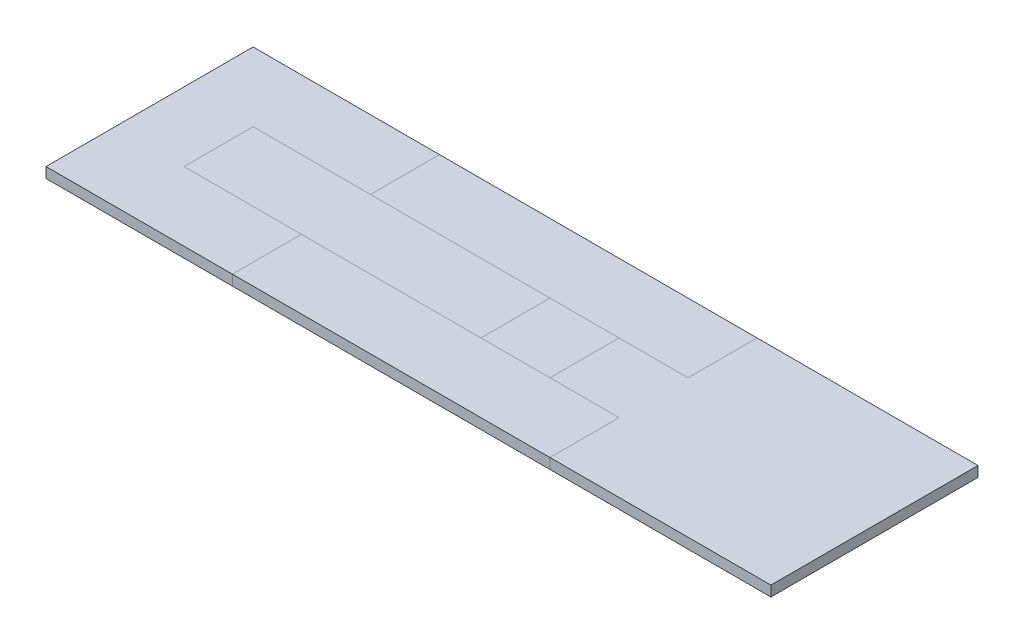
ISO-10303-21;
HEADER;
FILE_DESCRIPTION(('STEP AP214'),'2;1');
FILE_NAME('part.step','',(''),(''),'','','');
FILE_SCHEMA(('AUTOMOTIVE_DESIGN { 1 0 10303 214 1 1 1 1 }'));
ENDSEC;
DATA;
#1=APPLICATION_CONTEXT('core data for automotive mechanical design processes');
#2=APPLICATION_PROTOCOL_DEFINITION('international standard','automotive_design',2000,#1);
#3=PRODUCT_CONTEXT('',#1,'mechanical');
#4=PRODUCT('Part','Part','',(#3));
#5=PRODUCT_RELATED_PRODUCT_CATEGORY('part','',(#4));
#6=PRODUCT_DEFINITION_FORMATION('','',#4);
#7=PRODUCT_DEFINITION_CONTEXT('part definition',#1,'design');
#8=PRODUCT_DEFINITION('design','',#6,#7);
#9=PRODUCT_DEFINITION_SHAPE('','',#8);
#10=(LENGTH_UNIT() NAMED_UNIT(*) SI_UNIT(.MILLI.,.METRE.));
#11=(NAMED_UNIT(*) PLANE_ANGLE_UNIT() SI_UNIT($,.RADIAN.));
#12=(NAMED_UNIT(*) SI_UNIT($,.STERADIAN.) SOLID_ANGLE_UNIT());
#13=UNCERTAINTY_MEASURE_WITH_UNIT(LENGTH_MEASURE(1.E-05),#10,'distance_accuracy_value','');
#14=(GEOMETRIC_REPRESENTATION_CONTEXT(3) GLOBAL_UNCERTAINTY_ASSIGNED_CONTEXT((#13)) GLOBAL_UNIT_ASSIGNED_CONTEXT((#10,
#11,#12)) REPRESENTATION_CONTEXT('',''));
#15=CARTESIAN_POINT('',(0.,0.,0.));
#16=DIRECTION('',(0.,0.,1.));
#17=DIRECTION('',(1.,0.,0.));
#18=AXIS2_PLACEMENT_3D('',#15,#16,#17);
#19=CARTESIAN_POINT('',(31.5,-0.01,-5.));
#20=DIRECTION('',(0.,0.,-1.));
#21=DIRECTION('',(-1.,0.,0.));
#22=AXIS2_PLACEMENT_3D('',#19,#20,#21);
#23=PLANE('',#22);
#24=DIRECTION('',(0.,1.,0.));
#25=VECTOR('',#24,1.);
#26=CARTESIAN_POINT('',(41.5,-0.01,-5.));
#27=LINE('',#26,#25);
#28=CARTESIAN_POINT('',(41.5,0.,-5.));
#29=VERTEX_POINT('',#28);
#30=CARTESIAN_POINT('',(41.5,1.5,-5.));
#31=VERTEX_POINT('',#30);
#32=EDGE_CURVE('E12',#29,#31,#27,.T.);
#33=ORIENTED_EDGE('',*,*,#32,.F.);
#34=DIRECTION('',(-1.,0.,0.));
#35=VECTOR('',#34,1.);
#36=CARTESIAN_POINT('',(0.,0.,-4.99999999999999));
#37=LINE('',#36,#35);
#38=CARTESIAN_POINT('',(31.5,0.,-5.));
#39=VERTEX_POINT('',#38);
#40=EDGE_CURVE('E135',#29,#39,#37,.T.);
#41=ORIENTED_EDGE('',*,*,#40,.T.);
#42=DIRECTION('',(0.,1.,0.));
#43=VECTOR('',#42,1.);
#44=CARTESIAN_POINT('',(31.5,-0.01,-5.));
#45=LINE('',#44,#43);
#46=CARTESIAN_POINT('',(31.5,1.5,-5.));
#47=VERTEX_POINT('',#46);
#48=EDGE_CURVE('E151',#39,#47,#45,.T.);
#49=ORIENTED_EDGE('',*,*,#48,.T.);
#50=DIRECTION('',(-1.,0.,0.));
#51=VECTOR('',#50,1.);
#52=CARTESIAN_POINT('',(0.,1.5,-4.99999999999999));
#53=LINE('',#52,#51);
#54=EDGE_CURVE('E147',#31,#47,#53,.T.);
#55=ORIENTED_EDGE('',*,*,#54,.F.);
#56=EDGE_LOOP('',(#33,#41,#49,#55));
#57=FACE_BOUND('',#56,.T.);
#58=ADVANCED_FACE('F47',(#57),#23,.T.);
#59=CARTESIAN_POINT('',(41.5,-0.01,-15.));
#60=DIRECTION('',(-1.,0.,0.));
#61=DIRECTION('',(0.,0.,1.));
#62=AXIS2_PLACEMENT_3D('',#59,#60,#61);
#63=PLANE('',#62);
#64=DIRECTION('',(0.,1.,0.));
#65=VECTOR('',#64,1.);
#66=CARTESIAN_POINT('',(41.5,1.5,-15.));
#67=LINE('',#66,#65);
#68=CARTESIAN_POINT('',(41.5,0.,-15.));
#69=VERTEX_POINT('',#68);
#70=CARTESIAN_POINT('',(41.5,1.5,-15.));
#71=VERTEX_POINT('',#70);
#72=EDGE_CURVE('E131',#69,#71,#67,.T.);
#73=ORIENTED_EDGE('',*,*,#72,.F.);
#74=DIRECTION('',(0.,0.,1.));
#75=VECTOR('',#74,1.);
#76=CARTESIAN_POINT('',(41.5,0.,0.));
#77=LINE('',#76,#75);
#78=EDGE_CURVE('E139',#69,#29,#77,.T.);
#79=ORIENTED_EDGE('',*,*,#78,.T.);
#80=ORIENTED_EDGE('',*,*,#32,.T.);
#81=DIRECTION('',(0.,0.,1.));
#82=VECTOR('',#81,1.);
#83=CARTESIAN_POINT('',(41.5,1.5,0.));
#84=LINE('',#83,#82);
#85=EDGE_CURVE('E177',#71,#31,#84,.T.);
#86=ORIENTED_EDGE('',*,*,#85,.F.);
#87=EDGE_LOOP('',(#73,#79,#80,#86));
#88=FACE_BOUND('',#87,.T.);
#89=ADVANCED_FACE('F187',(#88),#63,.T.);
#90=CARTESIAN_POINT('',(41.5,-0.01,15.));
#91=DIRECTION('',(-1.,0.,0.));
#92=DIRECTION('',(0.,0.,1.));
#93=AXIS2_PLACEMENT_3D('',#90,#91,#92);
#94=PLANE('',#93);
#95=DIRECTION('',(0.,1.,0.));
#96=VECTOR('',#95,1.);
#97=CARTESIAN_POINT('',(41.5,-0.01,5.));
#98=LINE('',#97,#96);
#99=CARTESIAN_POINT('',(41.5,0.,5.));
#100=VERTEX_POINT('',#99);
#101=CARTESIAN_POINT('',(41.5,1.5,5.));
#102=VERTEX_POINT('',#101);
#103=EDGE_CURVE('E51',#100,#102,#98,.T.);
#104=ORIENTED_EDGE('',*,*,#103,.F.);
#105=DIRECTION('',(0.,0.,1.));
#106=VECTOR('',#105,1.);
#107=CARTESIAN_POINT('',(41.5,0.,0.));
#108=LINE('',#107,#106);
#109=CARTESIAN_POINT('',(41.5,0.,15.));
#110=VERTEX_POINT('',#109);
#111=EDGE_CURVE('E121',#100,#110,#108,.T.);
#112=ORIENTED_EDGE('',*,*,#111,.T.);
#113=DIRECTION('',(0.,1.,0.));
#114=VECTOR('',#113,1.);
#115=CARTESIAN_POINT('',(41.5,1.5,15.));
#116=LINE('',#115,#114);
#117=CARTESIAN_POINT('',(41.5,1.5,15.));
#118=VERTEX_POINT('',#117);
#119=EDGE_CURVE('E128',#110,#118,#116,.T.);
#120=ORIENTED_EDGE('',*,*,#119,.T.);
#121=DIRECTION('',(0.,0.,1.));
#122=VECTOR('',#121,1.);
#123=CARTESIAN_POINT('',(41.5,1.5,0.));
#124=LINE('',#123,#122);
#125=EDGE_CURVE('E144',#102,#118,#124,.T.);
#126=ORIENTED_EDGE('',*,*,#125,.F.);
#127=EDGE_LOOP('',(#104,#112,#120,#126));
#128=FACE_BOUND('',#127,.T.);
#129=ADVANCED_FACE('F134',(#128),#94,.T.);
#130=CARTESIAN_POINT('',(31.5,-0.01,5.));
#131=DIRECTION('',(0.,0.,1.));
#132=DIRECTION('',(1.,0.,0.));
#133=AXIS2_PLACEMENT_3D('',#130,#131,#132);
#134=PLANE('',#133);
#135=DIRECTION('',(0.,-1.,0.));
#136=VECTOR('',#135,1.);
#137=CARTESIAN_POINT('',(31.5,-0.01,5.));
#138=LINE('',#137,#136);
#139=CARTESIAN_POINT('',(31.5,1.5,5.));
#140=VERTEX_POINT('',#139);
#141=CARTESIAN_POINT('',(31.5,0.,5.));
#142=VERTEX_POINT('',#141);
#143=EDGE_CURVE('E124',#140,#142,#138,.T.);
#144=ORIENTED_EDGE('',*,*,#143,.T.);
#145=DIRECTION('',(1.,0.,0.));
#146=VECTOR('',#145,1.);
#147=CARTESIAN_POINT('',(0.,0.,5.));
#148=LINE('',#147,#146);
#149=EDGE_CURVE('E136',#142,#100,#148,.T.);
#150=ORIENTED_EDGE('',*,*,#149,.T.);
#151=ORIENTED_EDGE('',*,*,#103,.T.);
#152=DIRECTION('',(1.,0.,0.));
#153=VECTOR('',#152,1.);
#154=CARTESIAN_POINT('',(0.,1.5,5.));
#155=LINE('',#154,#153);
#156=EDGE_CURVE('E146',#140,#102,#155,.T.);
#157=ORIENTED_EDGE('',*,*,#156,.F.);
#158=EDGE_LOOP('',(#144,#150,#151,#157));
#159=FACE_BOUND('',#158,.T.);
#160=ADVANCED_FACE('F203',(#159),#134,.T.);
#161=CARTESIAN_POINT('',(31.5,-0.01,-5.));
#162=DIRECTION('',(-1.,0.,0.));
#163=DIRECTION('',(0.,0.,1.));
#164=AXIS2_PLACEMENT_3D('',#161,#162,#163);
#165=PLANE('',#164);
#166=ORIENTED_EDGE('',*,*,#48,.F.);
#167=DIRECTION('',(0.,0.,1.));
#168=VECTOR('',#167,1.);
#169=CARTESIAN_POINT('',(31.5,0.,0.));
#170=LINE('',#169,#168);
#171=EDGE_CURVE('E132',#39,#142,#170,.T.);
#172=ORIENTED_EDGE('',*,*,#171,.T.);
#173=ORIENTED_EDGE('',*,*,#143,.F.);
#174=DIRECTION('',(0.,0.,1.));
#175=VECTOR('',#174,1.);
#176=CARTESIAN_POINT('',(31.5,1.5,0.));
#177=LINE('',#176,#175);
#178=EDGE_CURVE('E175',#47,#140,#177,.T.);
#179=ORIENTED_EDGE('',*,*,#178,.F.);
#180=EDGE_LOOP('',(#166,#172,#173,#179));
#181=FACE_BOUND('',#180,.T.);
#182=ADVANCED_FACE('F198',(#181),#165,.T.);
#183=CARTESIAN_POINT('',(0.,1.5,15.));
#184=DIRECTION('',(0.,0.,-1.));
#185=DIRECTION('',(-1.,0.,0.));
#186=AXIS2_PLACEMENT_3D('',#183,#184,#185);
#187=PLANE('',#186);
#188=ORIENTED_EDGE('',*,*,#119,.F.);
#189=DIRECTION('',(1.,0.,0.));
#190=VECTOR('',#189,1.);
#191=CARTESIAN_POINT('',(0.,0.,15.));
#192=LINE('',#191,#190);
#193=CARTESIAN_POINT('',(73.5,0.,15.));
#194=VERTEX_POINT('',#193);
#195=EDGE_CURVE('E65',#110,#194,#192,.T.);
#196=ORIENTED_EDGE('',*,*,#195,.T.);
#197=DIRECTION('',(0.,-1.,0.));
#198=VECTOR('',#197,1.);
#199=CARTESIAN_POINT('',(73.5,1.5,15.));
#200=LINE('',#199,#198);
#201=CARTESIAN_POINT('',(73.5,1.5,15.));
#202=VERTEX_POINT('',#201);
#203=EDGE_CURVE('E149',#202,#194,#200,.T.);
#204=ORIENTED_EDGE('',*,*,#203,.F.);
#205=DIRECTION('',(1.,0.,0.));
#206=VECTOR('',#205,1.);
#207=CARTESIAN_POINT('',(0.,1.5,15.));
#208=LINE('',#207,#206);
#209=EDGE_CURVE('E130',#118,#202,#208,.T.);
#210=ORIENTED_EDGE('',*,*,#209,.F.);
#211=EDGE_LOOP('',(#188,#196,#204,#210));
#212=FACE_BOUND('',#211,.T.);
#213=ADVANCED_FACE('F129',(#212),#187,.F.);
#214=CARTESIAN_POINT('',(73.5,1.5,0.));
#215=DIRECTION('',(1.,0.,0.));
#216=DIRECTION('',(0.,0.,-1.));
#217=AXIS2_PLACEMENT_3D('',#214,#215,#216);
#218=PLANE('',#217);
#219=DIRECTION('',(0.,0.,1.));
#220=VECTOR('',#219,1.);
#221=CARTESIAN_POINT('',(73.5,0.,0.));
#222=LINE('',#221,#220);
#223=CARTESIAN_POINT('',(73.5,0.,-15.));
#224=VERTEX_POINT('',#223);
#225=EDGE_CURVE('E123',#224,#194,#222,.T.);
#226=ORIENTED_EDGE('',*,*,#225,.F.);
#227=DIRECTION('',(0.,-1.,0.));
#228=VECTOR('',#227,1.);
#229=CARTESIAN_POINT('',(73.5,1.5,-15.));
#230=LINE('',#229,#228);
#231=CARTESIAN_POINT('',(73.5,1.5,-15.));
#232=VERTEX_POINT('',#231);
#233=EDGE_CURVE('E166',#232,#224,#230,.T.);
#234=ORIENTED_EDGE('',*,*,#233,.F.);
#235=DIRECTION('',(0.,0.,1.));
#236=VECTOR('',#235,1.);
#237=CARTESIAN_POINT('',(73.5,1.5,0.));
#238=LINE('',#237,#236);
#239=EDGE_CURVE('E165',#232,#202,#238,.T.);
#240=ORIENTED_EDGE('',*,*,#239,.T.);
#241=ORIENTED_EDGE('',*,*,#203,.T.);
#242=EDGE_LOOP('',(#226,#234,#240,#241));
#243=FACE_BOUND('',#242,.T.);
#244=ADVANCED_FACE('F189',(#243),#218,.T.);
#245=CARTESIAN_POINT('',(0.,1.5,-15.));
#246=DIRECTION('',(0.,0.,-1.));
#247=DIRECTION('',(-1.,0.,0.));
#248=AXIS2_PLACEMENT_3D('',#245,#246,#247);
#249=PLANE('',#248);
#250=DIRECTION('',(1.,0.,0.));
#251=VECTOR('',#250,1.);
#252=CARTESIAN_POINT('',(0.,0.,-15.));
#253=LINE('',#252,#251);
#254=EDGE_CURVE('E163',#69,#224,#253,.T.);
#255=ORIENTED_EDGE('',*,*,#254,.F.);
#256=ORIENTED_EDGE('',*,*,#72,.T.);
#257=DIRECTION('',(1.,0.,0.));
#258=VECTOR('',#257,1.);
#259=CARTESIAN_POINT('',(0.,1.5,-15.));
#260=LINE('',#259,#258);
#261=EDGE_CURVE('E77',#71,#232,#260,.T.);
#262=ORIENTED_EDGE('',*,*,#261,.T.);
#263=ORIENTED_EDGE('',*,*,#233,.T.);
#264=EDGE_LOOP('',(#255,#256,#262,#263));
#265=FACE_BOUND('',#264,.T.);
#266=ADVANCED_FACE('F188',(#265),#249,.T.);
#267=CARTESIAN_POINT('',(0.,0.,0.));
#268=DIRECTION('',(0.,1.,0.));
#269=DIRECTION('',(0.,0.,1.));
#270=AXIS2_PLACEMENT_3D('',#267,#268,#269);
#271=PLANE('',#270);
#272=ORIENTED_EDGE('',*,*,#171,.F.);
#273=ORIENTED_EDGE('',*,*,#40,.F.);
#274=ORIENTED_EDGE('',*,*,#78,.F.);
#275=ORIENTED_EDGE('',*,*,#254,.T.);
#276=ORIENTED_EDGE('',*,*,#225,.T.);
#277=ORIENTED_EDGE('',*,*,#195,.F.);
#278=ORIENTED_EDGE('',*,*,#111,.F.);
#279=ORIENTED_EDGE('',*,*,#149,.F.);
#280=EDGE_LOOP('',(#272,#273,#274,#275,#276,#277,#278,#279));
#281=FACE_BOUND('',#280,.T.);
#282=ADVANCED_FACE('F119',(#281),#271,.F.);
#283=CARTESIAN_POINT('',(0.,1.5,0.));
#284=DIRECTION('',(0.,1.,0.));
#285=DIRECTION('',(0.,0.,1.));
#286=AXIS2_PLACEMENT_3D('',#283,#284,#285);
#287=PLANE('',#286);
#288=ORIENTED_EDGE('',*,*,#54,.T.);
#289=ORIENTED_EDGE('',*,*,#178,.T.);
#290=ORIENTED_EDGE('',*,*,#156,.T.);
#291=ORIENTED_EDGE('',*,*,#125,.T.);
#292=ORIENTED_EDGE('',*,*,#209,.T.);
#293=ORIENTED_EDGE('',*,*,#239,.F.);
#294=ORIENTED_EDGE('',*,*,#261,.F.);
#295=ORIENTED_EDGE('',*,*,#85,.T.);
#296=EDGE_LOOP('',(#288,#289,#290,#291,#292,#293,#294,#295));
#297=FACE_BOUND('',#296,.T.);
#298=ADVANCED_FACE('F49',(#297),#287,.T.);
#299=CLOSED_SHELL('',(#58,#89,#129,#160,#182,#213,#244,#266,#282,#298));
#300=MANIFOLD_SOLID_BREP('B2',#299);
#301=CARTESIAN_POINT('',(41.5,-0.01,15.));
#302=DIRECTION('',(-1.,0.,0.));
#303=DIRECTION('',(0.,0.,1.));
#304=AXIS2_PLACEMENT_3D('',#301,#302,#303);
#305=PLANE('',#304);
#306=DIRECTION('',(0.,1.,0.));
#307=VECTOR('',#306,1.);
#308=CARTESIAN_POINT('',(41.5,-0.01,5.));
#309=LINE('',#308,#307);
#310=CARTESIAN_POINT('',(41.5,0.,5.));
#311=VERTEX_POINT('',#310);
#312=CARTESIAN_POINT('',(41.5,1.5,5.));
#313=VERTEX_POINT('',#312);
#314=EDGE_CURVE('E324',#311,#313,#309,.T.);
#315=ORIENTED_EDGE('',*,*,#314,.T.);
#316=DIRECTION('',(0.,0.,1.));
#317=VECTOR('',#316,1.);
#318=CARTESIAN_POINT('',(41.5,1.5,0.));
#319=LINE('',#318,#317);
#320=CARTESIAN_POINT('',(41.5,1.5,15.));
#321=VERTEX_POINT('',#320);
#322=EDGE_CURVE('E375',#313,#321,#319,.T.);
#323=ORIENTED_EDGE('',*,*,#322,.T.);
#324=DIRECTION('',(0.,1.,0.));
#325=VECTOR('',#324,1.);
#326=CARTESIAN_POINT('',(41.5,1.5,15.));
#327=LINE('',#326,#325);
#328=CARTESIAN_POINT('',(41.5,0.,15.));
#329=VERTEX_POINT('',#328);
#330=EDGE_CURVE('E374',#329,#321,#327,.T.);
#331=ORIENTED_EDGE('',*,*,#330,.F.);
#332=DIRECTION('',(0.,0.,1.));
#333=VECTOR('',#332,1.);
#334=CARTESIAN_POINT('',(41.5,0.,0.));
#335=LINE('',#334,#333);
#336=EDGE_CURVE('E337',#311,#329,#335,.T.);
#337=ORIENTED_EDGE('',*,*,#336,.F.);
#338=EDGE_LOOP('',(#315,#323,#331,#337));
#339=FACE_BOUND('',#338,.T.);
#340=ADVANCED_FACE('F320',(#339),#305,.F.);
#341=CARTESIAN_POINT('',(31.5,-0.01,5.));
#342=DIRECTION('',(0.,0.,1.));
#343=DIRECTION('',(1.,0.,0.));
#344=AXIS2_PLACEMENT_3D('',#341,#342,#343);
#345=PLANE('',#344);
#346=DIRECTION('',(1.,0.,0.));
#347=VECTOR('',#346,1.);
#348=CARTESIAN_POINT('',(0.,0.,5.));
#349=LINE('',#348,#347);
#350=CARTESIAN_POINT('',(-4.5,0.,5.));
#351=VERTEX_POINT('',#350);
#352=EDGE_CURVE('E386',#351,#311,#349,.T.);
#353=ORIENTED_EDGE('',*,*,#352,.F.);
#354=DIRECTION('',(0.,1.,0.));
#355=VECTOR('',#354,1.);
#356=CARTESIAN_POINT('',(-4.5,-0.01,5.));
#357=LINE('',#356,#355);
#358=CARTESIAN_POINT('',(-4.5,1.5,5.));
#359=VERTEX_POINT('',#358);
#360=EDGE_CURVE('E45',#351,#359,#357,.T.);
#361=ORIENTED_EDGE('',*,*,#360,.T.);
#362=DIRECTION('',(-1.,0.,0.));
#363=VECTOR('',#362,1.);
#364=CARTESIAN_POINT('',(0.,1.5,5.));
#365=LINE('',#364,#363);
#366=EDGE_CURVE('E382',#313,#359,#365,.T.);
#367=ORIENTED_EDGE('',*,*,#366,.F.);
#368=ORIENTED_EDGE('',*,*,#314,.F.);
#369=EDGE_LOOP('',(#353,#361,#367,#368));
#370=FACE_BOUND('',#369,.T.);
#371=ADVANCED_FACE('F394',(#370),#345,.F.);
#372=CARTESIAN_POINT('',(-4.5,-0.01,15.));
#373=DIRECTION('',(-1.,0.,0.));
#374=DIRECTION('',(0.,0.,1.));
#375=AXIS2_PLACEMENT_3D('',#372,#373,#374);
#376=PLANE('',#375);
#377=ORIENTED_EDGE('',*,*,#360,.F.);
#378=DIRECTION('',(0.,0.,1.));
#379=VECTOR('',#378,1.);
#380=CARTESIAN_POINT('',(-4.5,0.,0.));
#381=LINE('',#380,#379);
#382=CARTESIAN_POINT('',(-4.5,0.,15.));
#383=VERTEX_POINT('',#382);
#384=EDGE_CURVE('E366',#351,#383,#381,.T.);
#385=ORIENTED_EDGE('',*,*,#384,.T.);
#386=DIRECTION('',(0.,1.,0.));
#387=VECTOR('',#386,1.);
#388=CARTESIAN_POINT('',(-4.5,1.5,15.));
#389=LINE('',#388,#387);
#390=CARTESIAN_POINT('',(-4.5,1.5,15.));
#391=VERTEX_POINT('',#390);
#392=EDGE_CURVE('E372',#383,#391,#389,.T.);
#393=ORIENTED_EDGE('',*,*,#392,.T.);
#394=DIRECTION('',(0.,0.,1.));
#395=VECTOR('',#394,1.);
#396=CARTESIAN_POINT('',(-4.5,1.5,0.));
#397=LINE('',#396,#395);
#398=EDGE_CURVE('E345',#359,#391,#397,.T.);
#399=ORIENTED_EDGE('',*,*,#398,.F.);
#400=EDGE_LOOP('',(#377,#385,#393,#399));
#401=FACE_BOUND('',#400,.T.);
#402=ADVANCED_FACE('F377',(#401),#376,.T.);
#403=CARTESIAN_POINT('',(0.,1.5,15.));
#404=DIRECTION('',(0.,0.,-1.));
#405=DIRECTION('',(-1.,0.,0.));
#406=AXIS2_PLACEMENT_3D('',#403,#404,#405);
#407=PLANE('',#406);
#408=DIRECTION('',(1.,0.,0.));
#409=VECTOR('',#408,1.);
#410=CARTESIAN_POINT('',(0.,0.,15.));
#411=LINE('',#410,#409);
#412=EDGE_CURVE('E329',#383,#329,#411,.T.);
#413=ORIENTED_EDGE('',*,*,#412,.T.);
#414=ORIENTED_EDGE('',*,*,#330,.T.);
#415=DIRECTION('',(1.,0.,0.));
#416=VECTOR('',#415,1.);
#417=CARTESIAN_POINT('',(0.,1.5,15.));
#418=LINE('',#417,#416);
#419=EDGE_CURVE('E369',#391,#321,#418,.T.);
#420=ORIENTED_EDGE('',*,*,#419,.F.);
#421=ORIENTED_EDGE('',*,*,#392,.F.);
#422=EDGE_LOOP('',(#413,#414,#420,#421));
#423=FACE_BOUND('',#422,.T.);
#424=ADVANCED_FACE('F322',(#423),#407,.F.);
#425=CARTESIAN_POINT('',(0.,0.,0.));
#426=DIRECTION('',(0.,1.,0.));
#427=DIRECTION('',(0.,0.,1.));
#428=AXIS2_PLACEMENT_3D('',#425,#426,#427);
#429=PLANE('',#428);
#430=ORIENTED_EDGE('',*,*,#352,.T.);
#431=ORIENTED_EDGE('',*,*,#336,.T.);
#432=ORIENTED_EDGE('',*,*,#412,.F.);
#433=ORIENTED_EDGE('',*,*,#384,.F.);
#434=EDGE_LOOP('',(#430,#431,#432,#433));
#435=FACE_BOUND('',#434,.T.);
#436=ADVANCED_FACE('F364',(#435),#429,.F.);
#437=CARTESIAN_POINT('',(0.,1.5,0.));
#438=DIRECTION('',(0.,1.,0.));
#439=DIRECTION('',(0.,0.,1.));
#440=AXIS2_PLACEMENT_3D('',#437,#438,#439);
#441=PLANE('',#440);
#442=ORIENTED_EDGE('',*,*,#322,.F.);
#443=ORIENTED_EDGE('',*,*,#366,.T.);
#444=ORIENTED_EDGE('',*,*,#398,.T.);
#445=ORIENTED_EDGE('',*,*,#419,.T.);
#446=EDGE_LOOP('',(#442,#443,#444,#445));
#447=FACE_BOUND('',#446,.T.);
#448=ADVANCED_FACE('F392',(#447),#441,.T.);
#449=CLOSED_SHELL('',(#340,#371,#402,#424,#436,#448));
#450=MANIFOLD_SOLID_BREP('B6',#449);
#451=CARTESIAN_POINT('',(-4.50000000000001,-0.01,-15.));
#452=DIRECTION('',(-1.,0.,0.));
#453=DIRECTION('',(0.,0.,1.));
#454=AXIS2_PLACEMENT_3D('',#451,#452,#453);
#455=PLANE('',#454);
#456=DIRECTION('',(0.,1.,0.));
#457=VECTOR('',#456,1.);
#458=CARTESIAN_POINT('',(-4.50000000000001,1.5,-15.));
#459=LINE('',#458,#457);
#460=CARTESIAN_POINT('',(-4.50000000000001,0.,-15.));
#461=VERTEX_POINT('',#460);
#462=CARTESIAN_POINT('',(-4.50000000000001,1.5,-15.));
#463=VERTEX_POINT('',#462);
#464=EDGE_CURVE('E606',#461,#463,#459,.T.);
#465=ORIENTED_EDGE('',*,*,#464,.T.);
#466=DIRECTION('',(0.,0.,1.));
#467=VECTOR('',#466,1.);
#468=CARTESIAN_POINT('',(-4.5,1.5,0.));
#469=LINE('',#468,#467);
#470=CARTESIAN_POINT('',(-4.5,1.5,-5.));
#471=VERTEX_POINT('',#470);
#472=EDGE_CURVE('E582',#463,#471,#469,.T.);
#473=ORIENTED_EDGE('',*,*,#472,.T.);
#474=DIRECTION('',(0.,1.,0.));
#475=VECTOR('',#474,1.);
#476=CARTESIAN_POINT('',(-4.5,-0.01,-5.));
#477=LINE('',#476,#475);
#478=CARTESIAN_POINT('',(-4.5,0.,-5.));
#479=VERTEX_POINT('',#478);
#480=EDGE_CURVE('E593',#479,#471,#477,.T.);
#481=ORIENTED_EDGE('',*,*,#480,.F.);
#482=DIRECTION('',(0.,0.,1.));
#483=VECTOR('',#482,1.);
#484=CARTESIAN_POINT('',(-4.5,0.,0.));
#485=LINE('',#484,#483);
#486=EDGE_CURVE('E566',#461,#479,#485,.T.);
#487=ORIENTED_EDGE('',*,*,#486,.F.);
#488=EDGE_LOOP('',(#465,#473,#481,#487));
#489=FACE_BOUND('',#488,.T.);
#490=ADVANCED_FACE('F489',(#489),#455,.F.);
#491=CARTESIAN_POINT('',(-4.5,-0.01,15.));
#492=DIRECTION('',(-1.,0.,0.));
#493=DIRECTION('',(0.,0.,1.));
#494=AXIS2_PLACEMENT_3D('',#491,#492,#493);
#495=PLANE('',#494);
#496=DIRECTION('',(0.,1.,0.));
#497=VECTOR('',#496,1.);
#498=CARTESIAN_POINT('',(-4.5,-0.01,5.));
#499=LINE('',#498,#497);
#500=CARTESIAN_POINT('',(-4.5,0.,5.));
#501=VERTEX_POINT('',#500);
#502=CARTESIAN_POINT('',(-4.5,1.5,5.));
#503=VERTEX_POINT('',#502);
#504=EDGE_CURVE('E493',#501,#503,#499,.T.);
#505=ORIENTED_EDGE('',*,*,#504,.T.);
#506=DIRECTION('',(0.,0.,1.));
#507=VECTOR('',#506,1.);
#508=CARTESIAN_POINT('',(-4.5,1.5,0.));
#509=LINE('',#508,#507);
#510=CARTESIAN_POINT('',(-4.5,1.5,15.));
#511=VERTEX_POINT('',#510);
#512=EDGE_CURVE('E580',#503,#511,#509,.T.);
#513=ORIENTED_EDGE('',*,*,#512,.T.);
#514=DIRECTION('',(0.,1.,0.));
#515=VECTOR('',#514,1.);
#516=CARTESIAN_POINT('',(-4.5,1.5,15.));
#517=LINE('',#516,#515);
#518=CARTESIAN_POINT('',(-4.5,0.,15.));
#519=VERTEX_POINT('',#518);
#520=EDGE_CURVE('E564',#519,#511,#517,.T.);
#521=ORIENTED_EDGE('',*,*,#520,.F.);
#522=DIRECTION('',(0.,0.,1.));
#523=VECTOR('',#522,1.);
#524=CARTESIAN_POINT('',(-4.5,0.,0.));
#525=LINE('',#524,#523);
#526=EDGE_CURVE('E526',#501,#519,#525,.T.);
#527=ORIENTED_EDGE('',*,*,#526,.F.);
#528=EDGE_LOOP('',(#505,#513,#521,#527));
#529=FACE_BOUND('',#528,.T.);
#530=ADVANCED_FACE('F561',(#529),#495,.F.);
#531=CARTESIAN_POINT('',(-21.5,-0.01,-5.));
#532=DIRECTION('',(0.,0.,1.));
#533=DIRECTION('',(1.,0.,0.));
#534=AXIS2_PLACEMENT_3D('',#531,#532,#533);
#535=PLANE('',#534);
#536=DIRECTION('',(0.,1.,0.));
#537=VECTOR('',#536,1.);
#538=CARTESIAN_POINT('',(-21.5,-0.01,-5.));
#539=LINE('',#538,#537);
#540=CARTESIAN_POINT('',(-21.5,0.,-5.));
#541=VERTEX_POINT('',#540);
#542=CARTESIAN_POINT('',(-21.5,1.5,-5.));
#543=VERTEX_POINT('',#542);
#544=EDGE_CURVE('E318',#541,#543,#539,.T.);
#545=ORIENTED_EDGE('',*,*,#544,.F.);
#546=DIRECTION('',(1.,0.,0.));
#547=VECTOR('',#546,1.);
#548=CARTESIAN_POINT('',(0.,0.,-5.));
#549=LINE('',#548,#547);
#550=EDGE_CURVE('E574',#541,#479,#549,.T.);
#551=ORIENTED_EDGE('',*,*,#550,.T.);
#552=ORIENTED_EDGE('',*,*,#480,.T.);
#553=DIRECTION('',(1.,0.,0.));
#554=VECTOR('',#553,1.);
#555=CARTESIAN_POINT('',(0.,1.5,-5.));
#556=LINE('',#555,#554);
#557=EDGE_CURVE('E590',#543,#471,#556,.T.);
#558=ORIENTED_EDGE('',*,*,#557,.F.);
#559=EDGE_LOOP('',(#545,#551,#552,#558));
#560=FACE_BOUND('',#559,.T.);
#561=ADVANCED_FACE('F622',(#560),#535,.T.);
#562=CARTESIAN_POINT('',(-21.5,-0.01,5.));
#563=DIRECTION('',(1.,0.,0.));
#564=DIRECTION('',(0.,0.,-1.));
#565=AXIS2_PLACEMENT_3D('',#562,#563,#564);
#566=PLANE('',#565);
#567=DIRECTION('',(0.,1.,0.));
#568=VECTOR('',#567,1.);
#569=CARTESIAN_POINT('',(-21.5,-0.01,5.));
#570=LINE('',#569,#568);
#571=CARTESIAN_POINT('',(-21.5,0.,5.));
#572=VERTEX_POINT('',#571);
#573=CARTESIAN_POINT('',(-21.5,1.5,5.));
#574=VERTEX_POINT('',#573);
#575=EDGE_CURVE('E499',#572,#574,#570,.T.);
#576=ORIENTED_EDGE('',*,*,#575,.F.);
#577=DIRECTION('',(0.,0.,-1.));
#578=VECTOR('',#577,1.);
#579=CARTESIAN_POINT('',(-21.5,0.,0.));
#580=LINE('',#579,#578);
#581=EDGE_CURVE('E579',#572,#541,#580,.T.);
#582=ORIENTED_EDGE('',*,*,#581,.T.);
#583=ORIENTED_EDGE('',*,*,#544,.T.);
#584=DIRECTION('',(0.,0.,-1.));
#585=VECTOR('',#584,1.);
#586=CARTESIAN_POINT('',(-21.5,1.5,0.));
#587=LINE('',#586,#585);
#588=EDGE_CURVE('E587',#574,#543,#587,.T.);
#589=ORIENTED_EDGE('',*,*,#588,.F.);
#590=EDGE_LOOP('',(#576,#582,#583,#589));
#591=FACE_BOUND('',#590,.T.);
#592=ADVANCED_FACE('F624',(#591),#566,.T.);
#593=CARTESIAN_POINT('',(-21.5,-0.01,5.));
#594=DIRECTION('',(0.,0.,-1.));
#595=DIRECTION('',(-1.,0.,0.));
#596=AXIS2_PLACEMENT_3D('',#593,#594,#595);
#597=PLANE('',#596);
#598=ORIENTED_EDGE('',*,*,#504,.F.);
#599=DIRECTION('',(-1.,0.,0.));
#600=VECTOR('',#599,1.);
#601=CARTESIAN_POINT('',(0.,0.,5.));
#602=LINE('',#601,#600);
#603=EDGE_CURVE('E571',#501,#572,#602,.T.);
#604=ORIENTED_EDGE('',*,*,#603,.T.);
#605=ORIENTED_EDGE('',*,*,#575,.T.);
#606=DIRECTION('',(-1.,0.,0.));
#607=VECTOR('',#606,1.);
#608=CARTESIAN_POINT('',(0.,1.5,5.));
#609=LINE('',#608,#607);
#610=EDGE_CURVE('E573',#503,#574,#609,.T.);
#611=ORIENTED_EDGE('',*,*,#610,.F.);
#612=EDGE_LOOP('',(#598,#604,#605,#611));
#613=FACE_BOUND('',#612,.T.);
#614=ADVANCED_FACE('F570',(#613),#597,.T.);
#615=CARTESIAN_POINT('',(0.,1.5,-15.));
#616=DIRECTION('',(0.,0.,-1.));
#617=DIRECTION('',(-1.,0.,0.));
#618=AXIS2_PLACEMENT_3D('',#615,#616,#617);
#619=PLANE('',#618);
#620=ORIENTED_EDGE('',*,*,#464,.F.);
#621=DIRECTION('',(1.,0.,0.));
#622=VECTOR('',#621,1.);
#623=CARTESIAN_POINT('',(0.,0.,-15.));
#624=LINE('',#623,#622);
#625=CARTESIAN_POINT('',(-31.5,0.,-15.));
#626=VERTEX_POINT('',#625);
#627=EDGE_CURVE('E595',#626,#461,#624,.T.);
#628=ORIENTED_EDGE('',*,*,#627,.F.);
#629=DIRECTION('',(0.,-1.,0.));
#630=VECTOR('',#629,1.);
#631=CARTESIAN_POINT('',(-31.5,1.5,-15.));
#632=LINE('',#631,#630);
#633=CARTESIAN_POINT('',(-31.5,1.5,-15.));
#634=VERTEX_POINT('',#633);
#635=EDGE_CURVE('E508',#634,#626,#632,.T.);
#636=ORIENTED_EDGE('',*,*,#635,.F.);
#637=DIRECTION('',(1.,0.,0.));
#638=VECTOR('',#637,1.);
#639=CARTESIAN_POINT('',(0.,1.5,-15.));
#640=LINE('',#639,#638);
#641=EDGE_CURVE('E600',#634,#463,#640,.T.);
#642=ORIENTED_EDGE('',*,*,#641,.T.);
#643=EDGE_LOOP('',(#620,#628,#636,#642));
#644=FACE_BOUND('',#643,.T.);
#645=ADVANCED_FACE('F633',(#644),#619,.T.);
#646=CARTESIAN_POINT('',(-31.5,1.5,0.));
#647=DIRECTION('',(1.,0.,0.));
#648=DIRECTION('',(0.,0.,-1.));
#649=AXIS2_PLACEMENT_3D('',#646,#647,#648);
#650=PLANE('',#649);
#651=DIRECTION('',(0.,0.,1.));
#652=VECTOR('',#651,1.);
#653=CARTESIAN_POINT('',(-31.5,0.,0.));
#654=LINE('',#653,#652);
#655=CARTESIAN_POINT('',(-31.5,0.,15.));
#656=VERTEX_POINT('',#655);
#657=EDGE_CURVE('E599',#626,#656,#654,.T.);
#658=ORIENTED_EDGE('',*,*,#657,.T.);
#659=DIRECTION('',(0.,-1.,0.));
#660=VECTOR('',#659,1.);
#661=CARTESIAN_POINT('',(-31.5,1.5,15.));
#662=LINE('',#661,#660);
#663=CARTESIAN_POINT('',(-31.5,1.5,15.));
#664=VERTEX_POINT('',#663);
#665=EDGE_CURVE('E621',#664,#656,#662,.T.);
#666=ORIENTED_EDGE('',*,*,#665,.F.);
#667=DIRECTION('',(0.,0.,1.));
#668=VECTOR('',#667,1.);
#669=CARTESIAN_POINT('',(-31.5,1.5,0.));
#670=LINE('',#669,#668);
#671=EDGE_CURVE('E518',#634,#664,#670,.T.);
#672=ORIENTED_EDGE('',*,*,#671,.F.);
#673=ORIENTED_EDGE('',*,*,#635,.T.);
#674=EDGE_LOOP('',(#658,#666,#672,#673));
#675=FACE_BOUND('',#674,.T.);
#676=ADVANCED_FACE('F645',(#675),#650,.F.);
#677=CARTESIAN_POINT('',(0.,1.5,15.));
#678=DIRECTION('',(0.,0.,-1.));
#679=DIRECTION('',(-1.,0.,0.));
#680=AXIS2_PLACEMENT_3D('',#677,#678,#679);
#681=PLANE('',#680);
#682=DIRECTION('',(1.,0.,0.));
#683=VECTOR('',#682,1.);
#684=CARTESIAN_POINT('',(0.,0.,15.));
#685=LINE('',#684,#683);
#686=EDGE_CURVE('E598',#656,#519,#685,.T.);
#687=ORIENTED_EDGE('',*,*,#686,.T.);
#688=ORIENTED_EDGE('',*,*,#520,.T.);
#689=DIRECTION('',(1.,0.,0.));
#690=VECTOR('',#689,1.);
#691=CARTESIAN_POINT('',(0.,1.5,15.));
#692=LINE('',#691,#690);
#693=EDGE_CURVE('E603',#664,#511,#692,.T.);
#694=ORIENTED_EDGE('',*,*,#693,.F.);
#695=ORIENTED_EDGE('',*,*,#665,.T.);
#696=EDGE_LOOP('',(#687,#688,#694,#695));
#697=FACE_BOUND('',#696,.T.);
#698=ADVANCED_FACE('F627',(#697),#681,.F.);
#699=CARTESIAN_POINT('',(0.,0.,0.));
#700=DIRECTION('',(0.,1.,0.));
#701=DIRECTION('',(0.,0.,1.));
#702=AXIS2_PLACEMENT_3D('',#699,#700,#701);
#703=PLANE('',#702);
#704=ORIENTED_EDGE('',*,*,#603,.F.);
#705=ORIENTED_EDGE('',*,*,#526,.T.);
#706=ORIENTED_EDGE('',*,*,#686,.F.);
#707=ORIENTED_EDGE('',*,*,#657,.F.);
#708=ORIENTED_EDGE('',*,*,#627,.T.);
#709=ORIENTED_EDGE('',*,*,#486,.T.);
#710=ORIENTED_EDGE('',*,*,#550,.F.);
#711=ORIENTED_EDGE('',*,*,#581,.F.);
#712=EDGE_LOOP('',(#704,#705,#706,#707,#708,#709,#710,#711));
#713=FACE_BOUND('',#712,.T.);
#714=ADVANCED_FACE('F576',(#713),#703,.F.);
#715=CARTESIAN_POINT('',(0.,1.5,0.));
#716=DIRECTION('',(0.,1.,0.));
#717=DIRECTION('',(0.,0.,1.));
#718=AXIS2_PLACEMENT_3D('',#715,#716,#717);
#719=PLANE('',#718);
#720=ORIENTED_EDGE('',*,*,#512,.F.);
#721=ORIENTED_EDGE('',*,*,#610,.T.);
#722=ORIENTED_EDGE('',*,*,#588,.T.);
#723=ORIENTED_EDGE('',*,*,#557,.T.);
#724=ORIENTED_EDGE('',*,*,#472,.F.);
#725=ORIENTED_EDGE('',*,*,#641,.F.);
#726=ORIENTED_EDGE('',*,*,#671,.T.);
#727=ORIENTED_EDGE('',*,*,#693,.T.);
#728=EDGE_LOOP('',(#720,#721,#722,#723,#724,#725,#726,#727));
#729=FACE_BOUND('',#728,.T.);
#730=ADVANCED_FACE('F491',(#729),#719,.T.);
#731=CLOSED_SHELL('',(#490,#530,#561,#592,#614,#645,#676,#698,#714,#730));
#732=MANIFOLD_SOLID_BREP('B39',#731);
#733=CARTESIAN_POINT('',(41.5,-0.01,-15.));
#734=DIRECTION('',(-1.,0.,0.));
#735=DIRECTION('',(0.,0.,1.));
#736=AXIS2_PLACEMENT_3D('',#733,#734,#735);
#737=PLANE('',#736);
#738=DIRECTION('',(0.,1.,0.));
#739=VECTOR('',#738,1.);
#740=CARTESIAN_POINT('',(41.5,1.5,-15.));
#741=LINE('',#740,#739);
#742=CARTESIAN_POINT('',(41.5,0.,-15.));
#743=VERTEX_POINT('',#742);
#744=CARTESIAN_POINT('',(41.5,1.5,-15.));
#745=VERTEX_POINT('',#744);
#746=EDGE_CURVE('E805',#743,#745,#741,.T.);
#747=ORIENTED_EDGE('',*,*,#746,.T.);
#748=DIRECTION('',(0.,0.,1.));
#749=VECTOR('',#748,1.);
#750=CARTESIAN_POINT('',(41.5,1.5,0.));
#751=LINE('',#750,#749);
#752=CARTESIAN_POINT('',(41.5,1.5,-5.));
#753=VERTEX_POINT('',#752);
#754=EDGE_CURVE('E816',#745,#753,#751,.T.);
#755=ORIENTED_EDGE('',*,*,#754,.T.);
#756=DIRECTION('',(0.,1.,0.));
#757=VECTOR('',#756,1.);
#758=CARTESIAN_POINT('',(41.5,-0.01,-5.));
#759=LINE('',#758,#757);
#760=CARTESIAN_POINT('',(41.5,0.,-5.));
#761=VERTEX_POINT('',#760);
#762=EDGE_CURVE('E760',#761,#753,#759,.T.);
#763=ORIENTED_EDGE('',*,*,#762,.F.);
#764=DIRECTION('',(0.,0.,1.));
#765=VECTOR('',#764,1.);
#766=CARTESIAN_POINT('',(41.5,0.,0.));
#767=LINE('',#766,#765);
#768=EDGE_CURVE('E773',#743,#761,#767,.T.);
#769=ORIENTED_EDGE('',*,*,#768,.F.);
#770=EDGE_LOOP('',(#747,#755,#763,#769));
#771=FACE_BOUND('',#770,.T.);
#772=ADVANCED_FACE('F756',(#771),#737,.F.);
#773=CARTESIAN_POINT('',(31.5,-0.01,-5.));
#774=DIRECTION('',(0.,0.,-1.));
#775=DIRECTION('',(-1.,0.,0.));
#776=AXIS2_PLACEMENT_3D('',#773,#774,#775);
#777=PLANE('',#776);
#778=DIRECTION('',(-1.,0.,0.));
#779=VECTOR('',#778,1.);
#780=CARTESIAN_POINT('',(0.,0.,-4.99999999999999));
#781=LINE('',#780,#779);
#782=CARTESIAN_POINT('',(-4.5,0.,-5.));
#783=VERTEX_POINT('',#782);
#784=EDGE_CURVE('E815',#761,#783,#781,.T.);
#785=ORIENTED_EDGE('',*,*,#784,.F.);
#786=ORIENTED_EDGE('',*,*,#762,.T.);
#787=DIRECTION('',(1.,0.,0.));
#788=VECTOR('',#787,1.);
#789=CARTESIAN_POINT('',(0.,1.5,-5.));
#790=LINE('',#789,#788);
#791=CARTESIAN_POINT('',(-4.5,1.5,-5.));
#792=VERTEX_POINT('',#791);
#793=EDGE_CURVE('E812',#792,#753,#790,.T.);
#794=ORIENTED_EDGE('',*,*,#793,.F.);
#795=DIRECTION('',(0.,1.,0.));
#796=VECTOR('',#795,1.);
#797=CARTESIAN_POINT('',(-4.5,-0.01,-5.));
#798=LINE('',#797,#796);
#799=EDGE_CURVE('E817',#783,#792,#798,.T.);
#800=ORIENTED_EDGE('',*,*,#799,.F.);
#801=EDGE_LOOP('',(#785,#786,#794,#800));
#802=FACE_BOUND('',#801,.T.);
#803=ADVANCED_FACE('F830',(#802),#777,.F.);
#804=CARTESIAN_POINT('',(-4.50000000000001,-0.01,-15.));
#805=DIRECTION('',(-1.,0.,0.));
#806=DIRECTION('',(0.,0.,1.));
#807=AXIS2_PLACEMENT_3D('',#804,#805,#806);
#808=PLANE('',#807);
#809=DIRECTION('',(0.,1.,0.));
#810=VECTOR('',#809,1.);
#811=CARTESIAN_POINT('',(-4.50000000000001,1.5,-15.));
#812=LINE('',#811,#810);
#813=CARTESIAN_POINT('',(-4.50000000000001,0.,-15.));
#814=VERTEX_POINT('',#813);
#815=CARTESIAN_POINT('',(-4.50000000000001,1.5,-15.));
#816=VERTEX_POINT('',#815);
#817=EDGE_CURVE('E803',#814,#816,#812,.T.);
#818=ORIENTED_EDGE('',*,*,#817,.F.);
#819=DIRECTION('',(0.,0.,1.));
#820=VECTOR('',#819,1.);
#821=CARTESIAN_POINT('',(-4.5,0.,0.));
#822=LINE('',#821,#820);
#823=EDGE_CURVE('E810',#814,#783,#822,.T.);
#824=ORIENTED_EDGE('',*,*,#823,.T.);
#825=ORIENTED_EDGE('',*,*,#799,.T.);
#826=DIRECTION('',(0.,0.,1.));
#827=VECTOR('',#826,1.);
#828=CARTESIAN_POINT('',(-4.5,1.5,0.));
#829=LINE('',#828,#827);
#830=EDGE_CURVE('E781',#816,#792,#829,.T.);
#831=ORIENTED_EDGE('',*,*,#830,.F.);
#832=EDGE_LOOP('',(#818,#824,#825,#831));
#833=FACE_BOUND('',#832,.T.);
#834=ADVANCED_FACE('F809',(#833),#808,.T.);
#835=CARTESIAN_POINT('',(0.,1.5,-15.));
#836=DIRECTION('',(0.,0.,-1.));
#837=DIRECTION('',(-1.,0.,0.));
#838=AXIS2_PLACEMENT_3D('',#835,#836,#837);
#839=PLANE('',#838);
#840=ORIENTED_EDGE('',*,*,#746,.F.);
#841=DIRECTION('',(1.,0.,0.));
#842=VECTOR('',#841,1.);
#843=CARTESIAN_POINT('',(0.,0.,-15.));
#844=LINE('',#843,#842);
#845=EDGE_CURVE('E487',#814,#743,#844,.T.);
#846=ORIENTED_EDGE('',*,*,#845,.F.);
#847=ORIENTED_EDGE('',*,*,#817,.T.);
#848=DIRECTION('',(1.,0.,0.));
#849=VECTOR('',#848,1.);
#850=CARTESIAN_POINT('',(0.,1.5,-15.));
#851=LINE('',#850,#849);
#852=EDGE_CURVE('E765',#816,#745,#851,.T.);
#853=ORIENTED_EDGE('',*,*,#852,.T.);
#854=EDGE_LOOP('',(#840,#846,#847,#853));
#855=FACE_BOUND('',#854,.T.);
#856=ADVANCED_FACE('F801',(#855),#839,.T.);
#857=CARTESIAN_POINT('',(0.,0.,0.));
#858=DIRECTION('',(0.,1.,0.));
#859=DIRECTION('',(0.,0.,1.));
#860=AXIS2_PLACEMENT_3D('',#857,#858,#859);
#861=PLANE('',#860);
#862=ORIENTED_EDGE('',*,*,#845,.T.);
#863=ORIENTED_EDGE('',*,*,#768,.T.);
#864=ORIENTED_EDGE('',*,*,#784,.T.);
#865=ORIENTED_EDGE('',*,*,#823,.F.);
#866=EDGE_LOOP('',(#862,#863,#864,#865));
#867=FACE_BOUND('',#866,.T.);
#868=ADVANCED_FACE('F814',(#867),#861,.F.);
#869=CARTESIAN_POINT('',(0.,1.5,0.));
#870=DIRECTION('',(0.,1.,0.));
#871=DIRECTION('',(0.,0.,1.));
#872=AXIS2_PLACEMENT_3D('',#869,#870,#871);
#873=PLANE('',#872);
#874=ORIENTED_EDGE('',*,*,#754,.F.);
#875=ORIENTED_EDGE('',*,*,#852,.F.);
#876=ORIENTED_EDGE('',*,*,#830,.T.);
#877=ORIENTED_EDGE('',*,*,#793,.T.);
#878=EDGE_LOOP('',(#874,#875,#876,#877));
#879=FACE_BOUND('',#878,.T.);
#880=ADVANCED_FACE('F758',(#879),#873,.T.);
#881=CLOSED_SHELL('',(#772,#803,#834,#856,#868,#880));
#882=MANIFOLD_SOLID_BREP('B312',#881);
#883=CARTESIAN_POINT('',(-4.5,-0.01,-5.));
#884=DIRECTION('',(0.,0.,1.));
#885=DIRECTION('',(1.,0.,0.));
#886=AXIS2_PLACEMENT_3D('',#883,#884,#885);
#887=PLANE('',#886);
#888=DIRECTION('',(1.,0.,0.));
#889=VECTOR('',#888,1.);
#890=CARTESIAN_POINT('',(0.,0.,-5.));
#891=LINE('',#890,#889);
#892=CARTESIAN_POINT('',(-21.5,0.,-5.));
#893=VERTEX_POINT('',#892);
#894=CARTESIAN_POINT('',(21.5,0.,-5.));
#895=VERTEX_POINT('',#894);
#896=EDGE_CURVE('E933',#893,#895,#891,.T.);
#897=ORIENTED_EDGE('',*,*,#896,.F.);
#898=DIRECTION('',(0.,1.,0.));
#899=VECTOR('',#898,1.);
#900=CARTESIAN_POINT('',(-21.5,-0.01,-5.));
#901=LINE('',#900,#899);
#902=CARTESIAN_POINT('',(-21.5,1.5,-5.));
#903=VERTEX_POINT('',#902);
#904=EDGE_CURVE('E928',#893,#903,#901,.T.);
#905=ORIENTED_EDGE('',*,*,#904,.T.);
#906=DIRECTION('',(1.,0.,0.));
#907=VECTOR('',#906,1.);
#908=CARTESIAN_POINT('',(0.,1.5,-5.));
#909=LINE('',#908,#907);
#910=CARTESIAN_POINT('',(21.5,1.5,-5.));
#911=VERTEX_POINT('',#910);
#912=EDGE_CURVE('E985',#903,#911,#909,.T.);
#913=ORIENTED_EDGE('',*,*,#912,.T.);
#914=DIRECTION('',(0.,1.,0.));
#915=VECTOR('',#914,1.);
#916=CARTESIAN_POINT('',(21.5,-0.01,-5.));
#917=LINE('',#916,#915);
#918=EDGE_CURVE('E968',#895,#911,#917,.T.);
#919=ORIENTED_EDGE('',*,*,#918,.F.);
#920=EDGE_LOOP('',(#897,#905,#913,#919));
#921=FACE_BOUND('',#920,.T.);
#922=ADVANCED_FACE('F924',(#921),#887,.F.);
#923=CARTESIAN_POINT('',(21.5,-0.01,5.));
#924=DIRECTION('',(0.,0.,-1.));
#925=DIRECTION('',(-1.,0.,0.));
#926=AXIS2_PLACEMENT_3D('',#923,#924,#925);
#927=PLANE('',#926);
#928=DIRECTION('',(0.,1.,0.));
#929=VECTOR('',#928,1.);
#930=CARTESIAN_POINT('',(21.5,-0.01,5.));
#931=LINE('',#930,#929);
#932=CARTESIAN_POINT('',(21.5,0.,5.));
#933=VERTEX_POINT('',#932);
#934=CARTESIAN_POINT('',(21.5,1.5,5.));
#935=VERTEX_POINT('',#934);
#936=EDGE_CURVE('E981',#933,#935,#931,.T.);
#937=ORIENTED_EDGE('',*,*,#936,.T.);
#938=DIRECTION('',(-1.,0.,0.));
#939=VECTOR('',#938,1.);
#940=CARTESIAN_POINT('',(0.,1.5,5.));
#941=LINE('',#940,#939);
#942=CARTESIAN_POINT('',(-21.5,1.5,5.));
#943=VERTEX_POINT('',#942);
#944=EDGE_CURVE('E988',#935,#943,#941,.T.);
#945=ORIENTED_EDGE('',*,*,#944,.T.);
#946=DIRECTION('',(0.,1.,0.));
#947=VECTOR('',#946,1.);
#948=CARTESIAN_POINT('',(-21.5,-0.01,5.));
#949=LINE('',#948,#947);
#950=CARTESIAN_POINT('',(-21.5,0.,5.));
#951=VERTEX_POINT('',#950);
#952=EDGE_CURVE('E980',#951,#943,#949,.T.);
#953=ORIENTED_EDGE('',*,*,#952,.F.);
#954=DIRECTION('',(-1.,0.,0.));
#955=VECTOR('',#954,1.);
#956=CARTESIAN_POINT('',(0.,0.,5.));
#957=LINE('',#956,#955);
#958=EDGE_CURVE('E754',#933,#951,#957,.T.);
#959=ORIENTED_EDGE('',*,*,#958,.F.);
#960=EDGE_LOOP('',(#937,#945,#953,#959));
#961=FACE_BOUND('',#960,.T.);
#962=ADVANCED_FACE('F997',(#961),#927,.F.);
#963=CARTESIAN_POINT('',(21.5,-0.01,5.));
#964=DIRECTION('',(-1.,0.,0.));
#965=DIRECTION('',(0.,0.,1.));
#966=AXIS2_PLACEMENT_3D('',#963,#964,#965);
#967=PLANE('',#966);
#968=ORIENTED_EDGE('',*,*,#918,.T.);
#969=DIRECTION('',(0.,0.,1.));
#970=VECTOR('',#969,1.);
#971=CARTESIAN_POINT('',(21.5,1.5,0.));
#972=LINE('',#971,#970);
#973=EDGE_CURVE('E990',#911,#935,#972,.T.);
#974=ORIENTED_EDGE('',*,*,#973,.T.);
#975=ORIENTED_EDGE('',*,*,#936,.F.);
#976=DIRECTION('',(0.,0.,1.));
#977=VECTOR('',#976,1.);
#978=CARTESIAN_POINT('',(21.5,0.,0.));
#979=LINE('',#978,#977);
#980=EDGE_CURVE('E975',#895,#933,#979,.T.);
#981=ORIENTED_EDGE('',*,*,#980,.F.);
#982=EDGE_LOOP('',(#968,#974,#975,#981));
#983=FACE_BOUND('',#982,.T.);
#984=ADVANCED_FACE('F995',(#983),#967,.F.);
#985=CARTESIAN_POINT('',(-21.5,-0.01,5.));
#986=DIRECTION('',(1.,0.,0.));
#987=DIRECTION('',(0.,0.,-1.));
#988=AXIS2_PLACEMENT_3D('',#985,#986,#987);
#989=PLANE('',#988);
#990=ORIENTED_EDGE('',*,*,#952,.T.);
#991=DIRECTION('',(0.,0.,-1.));
#992=VECTOR('',#991,1.);
#993=CARTESIAN_POINT('',(-21.5,1.5,0.));
#994=LINE('',#993,#992);
#995=EDGE_CURVE('E979',#943,#903,#994,.T.);
#996=ORIENTED_EDGE('',*,*,#995,.T.);
#997=ORIENTED_EDGE('',*,*,#904,.F.);
#998=DIRECTION('',(0.,0.,-1.));
#999=VECTOR('',#998,1.);
#1000=CARTESIAN_POINT('',(-21.5,0.,0.));
#1001=LINE('',#1000,#999);
#1002=EDGE_CURVE('E969',#951,#893,#1001,.T.);
#1003=ORIENTED_EDGE('',*,*,#1002,.F.);
#1004=EDGE_LOOP('',(#990,#996,#997,#1003));
#1005=FACE_BOUND('',#1004,.T.);
#1006=ADVANCED_FACE('F977',(#1005),#989,.F.);
#1007=CARTESIAN_POINT('',(0.,0.,0.));
#1008=DIRECTION('',(0.,1.,0.));
#1009=DIRECTION('',(0.,0.,1.));
#1010=AXIS2_PLACEMENT_3D('',#1007,#1008,#1009);
#1011=PLANE('',#1010);
#1012=ORIENTED_EDGE('',*,*,#896,.T.);
#1013=ORIENTED_EDGE('',*,*,#980,.T.);
#1014=ORIENTED_EDGE('',*,*,#958,.T.);
#1015=ORIENTED_EDGE('',*,*,#1002,.T.);
#1016=EDGE_LOOP('',(#1012,#1013,#1014,#1015));
#1017=FACE_BOUND('',#1016,.T.);
#1018=ADVANCED_FACE('F972',(#1017),#1011,.F.);
#1019=CARTESIAN_POINT('',(0.,1.5,0.));
#1020=DIRECTION('',(0.,1.,0.));
#1021=DIRECTION('',(0.,0.,1.));
#1022=AXIS2_PLACEMENT_3D('',#1019,#1020,#1021);
#1023=PLANE('',#1022);
#1024=ORIENTED_EDGE('',*,*,#973,.F.);
#1025=ORIENTED_EDGE('',*,*,#912,.F.);
#1026=ORIENTED_EDGE('',*,*,#995,.F.);
#1027=ORIENTED_EDGE('',*,*,#944,.F.);
#1028=EDGE_LOOP('',(#1024,#1025,#1026,#1027));
#1029=FACE_BOUND('',#1028,.T.);
#1030=ADVANCED_FACE('F926',(#1029),#1023,.T.);
#1031=CLOSED_SHELL('',(#922,#962,#984,#1006,#1018,#1030));
#1032=MANIFOLD_SOLID_BREP('B481',#1031);
#1033=CARTESIAN_POINT('',(31.5,-0.01,-5.));
#1034=DIRECTION('',(-1.,0.,0.));
#1035=DIRECTION('',(0.,0.,1.));
#1036=AXIS2_PLACEMENT_3D('',#1033,#1034,#1035);
#1037=PLANE('',#1036);
#1038=DIRECTION('',(0.,1.,0.));
#1039=VECTOR('',#1038,1.);
#1040=CARTESIAN_POINT('',(31.5,-0.01,-5.));
#1041=LINE('',#1040,#1039);
#1042=CARTESIAN_POINT('',(31.5,0.,-5.));
#1043=VERTEX_POINT('',#1042);
#1044=CARTESIAN_POINT('',(31.5,1.5,-5.));
#1045=VERTEX_POINT('',#1044);
#1046=EDGE_CURVE('E922',#1043,#1045,#1041,.T.);
#1047=ORIENTED_EDGE('',*,*,#1046,.T.);
#1048=DIRECTION('',(0.,0.,1.));
#1049=VECTOR('',#1048,1.);
#1050=CARTESIAN_POINT('',(31.5,1.5,0.));
#1051=LINE('',#1050,#1049);
#1052=CARTESIAN_POINT('',(31.5,1.5,5.));
#1053=VERTEX_POINT('',#1052);
#1054=EDGE_CURVE('E1113',#1045,#1053,#1051,.T.);
#1055=ORIENTED_EDGE('',*,*,#1054,.T.);
#1056=DIRECTION('',(0.,-1.,0.));
#1057=VECTOR('',#1056,1.);
#1058=CARTESIAN_POINT('',(31.5,-0.01,5.));
#1059=LINE('',#1058,#1057);
#1060=CARTESIAN_POINT('',(31.5,0.,5.));
#1061=VERTEX_POINT('',#1060);
#1062=EDGE_CURVE('E1074',#1053,#1061,#1059,.T.);
#1063=ORIENTED_EDGE('',*,*,#1062,.T.);
#1064=DIRECTION('',(0.,0.,1.));
#1065=VECTOR('',#1064,1.);
#1066=CARTESIAN_POINT('',(31.5,0.,0.));
#1067=LINE('',#1066,#1065);
#1068=EDGE_CURVE('E1092',#1043,#1061,#1067,.T.);
#1069=ORIENTED_EDGE('',*,*,#1068,.F.);
#1070=EDGE_LOOP('',(#1047,#1055,#1063,#1069));
#1071=FACE_BOUND('',#1070,.T.);
#1072=ADVANCED_FACE('F1071',(#1071),#1037,.F.);
#1073=CARTESIAN_POINT('',(31.5,-0.01,5.));
#1074=DIRECTION('',(0.,0.,1.));
#1075=DIRECTION('',(1.,0.,0.));
#1076=AXIS2_PLACEMENT_3D('',#1073,#1074,#1075);
#1077=PLANE('',#1076);
#1078=DIRECTION('',(0.,1.,0.));
#1079=VECTOR('',#1078,1.);
#1080=CARTESIAN_POINT('',(21.5,-0.01,5.));
#1081=LINE('',#1080,#1079);
#1082=CARTESIAN_POINT('',(21.5,0.,5.));
#1083=VERTEX_POINT('',#1082);
#1084=CARTESIAN_POINT('',(21.5,1.5,5.));
#1085=VERTEX_POINT('',#1084);
#1086=EDGE_CURVE('E1133',#1083,#1085,#1081,.T.);
#1087=ORIENTED_EDGE('',*,*,#1086,.F.);
#1088=DIRECTION('',(1.,0.,0.));
#1089=VECTOR('',#1088,1.);
#1090=CARTESIAN_POINT('',(0.,0.,5.));
#1091=LINE('',#1090,#1089);
#1092=EDGE_CURVE('E1135',#1083,#1061,#1091,.T.);
#1093=ORIENTED_EDGE('',*,*,#1092,.T.);
#1094=ORIENTED_EDGE('',*,*,#1062,.F.);
#1095=DIRECTION('',(1.,0.,0.));
#1096=VECTOR('',#1095,1.);
#1097=CARTESIAN_POINT('',(0.,1.5,5.));
#1098=LINE('',#1097,#1096);
#1099=EDGE_CURVE('E1119',#1085,#1053,#1098,.T.);
#1100=ORIENTED_EDGE('',*,*,#1099,.F.);
#1101=EDGE_LOOP('',(#1087,#1093,#1094,#1100));
#1102=FACE_BOUND('',#1101,.T.);
#1103=ADVANCED_FACE('F1144',(#1102),#1077,.T.);
#1104=CARTESIAN_POINT('',(31.5,-0.01,-5.));
#1105=DIRECTION('',(0.,0.,-1.));
#1106=DIRECTION('',(-1.,0.,0.));
#1107=AXIS2_PLACEMENT_3D('',#1104,#1105,#1106);
#1108=PLANE('',#1107);
#1109=ORIENTED_EDGE('',*,*,#1046,.F.);
#1110=DIRECTION('',(-1.,0.,0.));
#1111=VECTOR('',#1110,1.);
#1112=CARTESIAN_POINT('',(0.,0.,-4.99999999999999));
#1113=LINE('',#1112,#1111);
#1114=CARTESIAN_POINT('',(21.5,0.,-5.));
#1115=VERTEX_POINT('',#1114);
#1116=EDGE_CURVE('E1137',#1043,#1115,#1113,.T.);
#1117=ORIENTED_EDGE('',*,*,#1116,.T.);
#1118=DIRECTION('',(0.,1.,0.));
#1119=VECTOR('',#1118,1.);
#1120=CARTESIAN_POINT('',(21.5,-0.01,-5.));
#1121=LINE('',#1120,#1119);
#1122=CARTESIAN_POINT('',(21.5,1.5,-5.));
#1123=VERTEX_POINT('',#1122);
#1124=EDGE_CURVE('E1127',#1115,#1123,#1121,.T.);
#1125=ORIENTED_EDGE('',*,*,#1124,.T.);
#1126=DIRECTION('',(-1.,0.,0.));
#1127=VECTOR('',#1126,1.);
#1128=CARTESIAN_POINT('',(0.,1.5,-4.99999999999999));
#1129=LINE('',#1128,#1127);
#1130=EDGE_CURVE('E1116',#1045,#1123,#1129,.T.);
#1131=ORIENTED_EDGE('',*,*,#1130,.F.);
#1132=EDGE_LOOP('',(#1109,#1117,#1125,#1131));
#1133=FACE_BOUND('',#1132,.T.);
#1134=ADVANCED_FACE('F1126',(#1133),#1108,.T.);
#1135=CARTESIAN_POINT('',(21.5,-0.01,5.));
#1136=DIRECTION('',(-1.,0.,0.));
#1137=DIRECTION('',(0.,0.,1.));
#1138=AXIS2_PLACEMENT_3D('',#1135,#1136,#1137);
#1139=PLANE('',#1138);
#1140=ORIENTED_EDGE('',*,*,#1124,.F.);
#1141=DIRECTION('',(0.,0.,1.));
#1142=VECTOR('',#1141,1.);
#1143=CARTESIAN_POINT('',(21.5,0.,0.));
#1144=LINE('',#1143,#1142);
#1145=EDGE_CURVE('E1085',#1115,#1083,#1144,.T.);
#1146=ORIENTED_EDGE('',*,*,#1145,.T.);
#1147=ORIENTED_EDGE('',*,*,#1086,.T.);
#1148=DIRECTION('',(0.,0.,1.));
#1149=VECTOR('',#1148,1.);
#1150=CARTESIAN_POINT('',(21.5,1.5,0.));
#1151=LINE('',#1150,#1149);
#1152=EDGE_CURVE('E1121',#1123,#1085,#1151,.T.);
#1153=ORIENTED_EDGE('',*,*,#1152,.F.);
#1154=EDGE_LOOP('',(#1140,#1146,#1147,#1153));
#1155=FACE_BOUND('',#1154,.T.);
#1156=ADVANCED_FACE('F1143',(#1155),#1139,.T.);
#1157=CARTESIAN_POINT('',(0.,0.,0.));
#1158=DIRECTION('',(0.,1.,0.));
#1159=DIRECTION('',(0.,0.,1.));
#1160=AXIS2_PLACEMENT_3D('',#1157,#1158,#1159);
#1161=PLANE('',#1160);
#1162=ORIENTED_EDGE('',*,*,#1145,.F.);
#1163=ORIENTED_EDGE('',*,*,#1116,.F.);
#1164=ORIENTED_EDGE('',*,*,#1068,.T.);
#1165=ORIENTED_EDGE('',*,*,#1092,.F.);
#1166=EDGE_LOOP('',(#1162,#1163,#1164,#1165));
#1167=FACE_BOUND('',#1166,.T.);
#1168=ADVANCED_FACE('F1153',(#1167),#1161,.F.);
#1169=CARTESIAN_POINT('',(0.,1.5,0.));
#1170=DIRECTION('',(0.,1.,0.));
#1171=DIRECTION('',(0.,0.,1.));
#1172=AXIS2_PLACEMENT_3D('',#1169,#1170,#1171);
#1173=PLANE('',#1172);
#1174=ORIENTED_EDGE('',*,*,#1130,.T.);
#1175=ORIENTED_EDGE('',*,*,#1152,.T.);
#1176=ORIENTED_EDGE('',*,*,#1099,.T.);
#1177=ORIENTED_EDGE('',*,*,#1054,.F.);
#1178=EDGE_LOOP('',(#1174,#1175,#1176,#1177));
#1179=FACE_BOUND('',#1178,.T.);
#1180=ADVANCED_FACE('F1114',(#1179),#1173,.T.);
#1181=CLOSED_SHELL('',(#1072,#1103,#1134,#1156,#1168,#1180));
#1182=MANIFOLD_SOLID_BREP('B748',#1181);
#1183=ADVANCED_BREP_SHAPE_REPRESENTATION('',(#18,#300,#450,#732,#882,#1032,#1182),#14);
#1184=SHAPE_DEFINITION_REPRESENTATION(#9,#1183);
ENDSEC;
END-ISO-10303-21;
